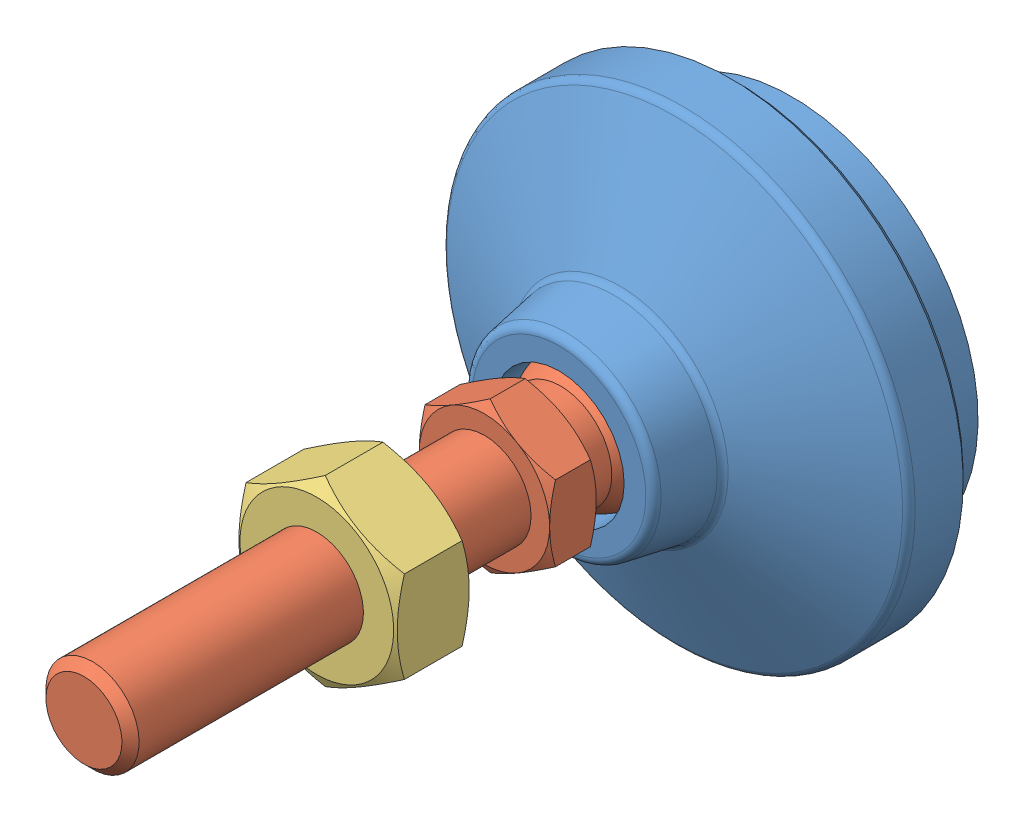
SolidWorks assembly LSVA50-M10X43.sldasm, configuration Default (file format 15000). Lengths in mm.
Overall size (50 50 76).
3 component instances, 3 part files, 0 mates.
Components (placement in the parent):
- LSVA50-M10X43_01-1: LSVA50-M10X43_01.SLDPRT [ﾃﾞﾌｫﾙﾄ] at (0 0 6) x (1 0 0) z (0 -1 0) size (50 25 50)
- LSVA50-M10X43_02-1: LSVA50-M10X43_02.SLDPRT [ﾃﾞﾌｫﾙﾄ] at (0 0 13.5) x (1 0 0) z (0 -1 0) size (14 62.5 16.17)
- LSVA50-M10X43_03-1: LSVA50-M10X43_03.SLDPRT [ﾃﾞﾌｫﾙﾄ] at (0 0 43) size (17 19.63 8)
